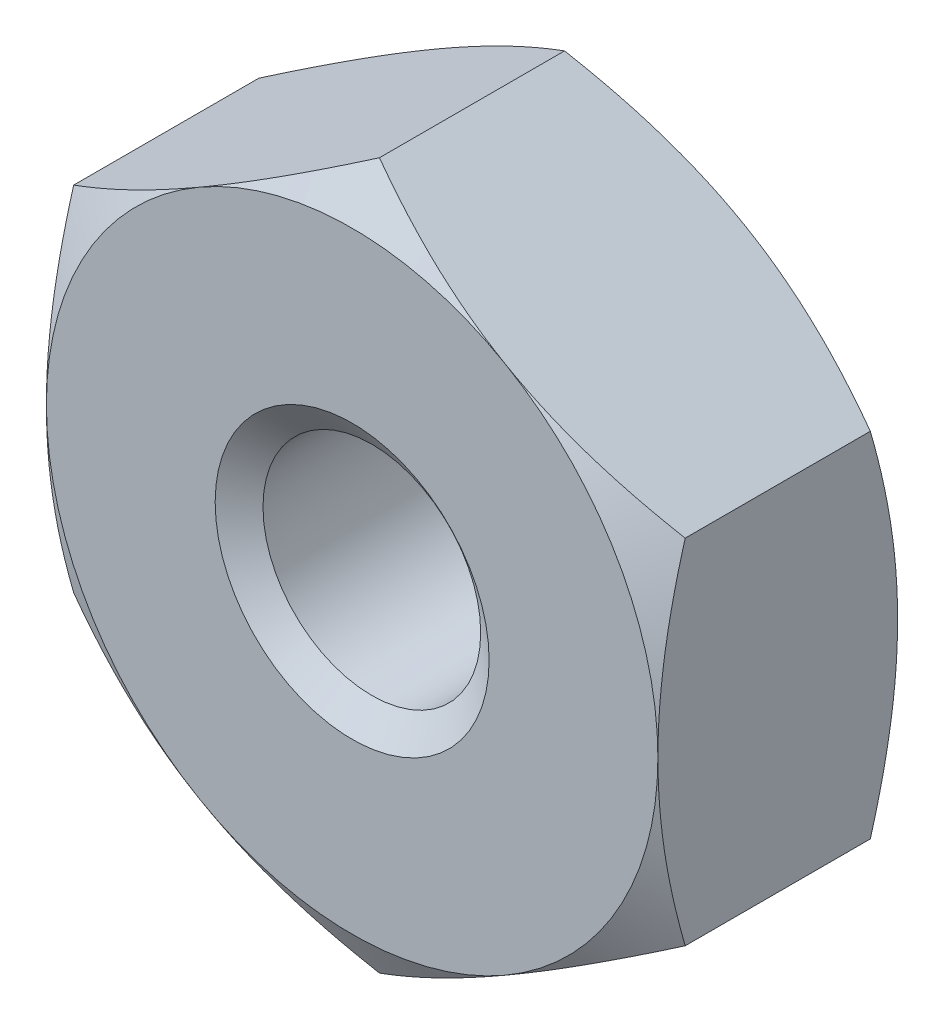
ISO-10303-21;
HEADER;
FILE_DESCRIPTION(('STEP AP214'),'2;1');
FILE_NAME('part.step','',(''),(''),'','','');
FILE_SCHEMA(('AUTOMOTIVE_DESIGN { 1 0 10303 214 1 1 1 1 }'));
ENDSEC;
DATA;
#1=APPLICATION_CONTEXT('core data for automotive mechanical design processes');
#2=APPLICATION_PROTOCOL_DEFINITION('international standard','automotive_design',2000,#1);
#3=PRODUCT_CONTEXT('',#1,'mechanical');
#4=PRODUCT('Part','Part','',(#3));
#5=PRODUCT_RELATED_PRODUCT_CATEGORY('part','',(#4));
#6=PRODUCT_DEFINITION_FORMATION('','',#4);
#7=PRODUCT_DEFINITION_CONTEXT('part definition',#1,'design');
#8=PRODUCT_DEFINITION('design','',#6,#7);
#9=PRODUCT_DEFINITION_SHAPE('','',#8);
#10=(LENGTH_UNIT() NAMED_UNIT(*) SI_UNIT(.MILLI.,.METRE.));
#11=(NAMED_UNIT(*) PLANE_ANGLE_UNIT() SI_UNIT($,.RADIAN.));
#12=(NAMED_UNIT(*) SI_UNIT($,.STERADIAN.) SOLID_ANGLE_UNIT());
#13=UNCERTAINTY_MEASURE_WITH_UNIT(LENGTH_MEASURE(1.E-05),#10,'distance_accuracy_value','');
#14=(GEOMETRIC_REPRESENTATION_CONTEXT(3) GLOBAL_UNCERTAINTY_ASSIGNED_CONTEXT((#13)) GLOBAL_UNIT_ASSIGNED_CONTEXT((#10,
#11,#12)) REPRESENTATION_CONTEXT('',''));
#15=CARTESIAN_POINT('',(0.,0.,0.));
#16=DIRECTION('',(0.,0.,1.));
#17=DIRECTION('',(1.,0.,0.));
#18=AXIS2_PLACEMENT_3D('',#15,#16,#17);
#19=CARTESIAN_POINT('',(0.,0.,-2.4892));
#20=DIRECTION('',(0.,0.,1.));
#21=DIRECTION('',(1.,0.,0.));
#22=AXIS2_PLACEMENT_3D('',#19,#20,#21);
#23=CYLINDRICAL_SURFACE('',#22,1.1303);
#24=CARTESIAN_POINT('',(0.,0.,-0.204530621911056));
#25=DIRECTION('',(0.,0.,1.));
#26=DIRECTION('',(1.,0.,0.));
#27=AXIS2_PLACEMENT_3D('',#24,#25,#26);
#28=CIRCLE('',#27,1.1303);
#29=CARTESIAN_POINT('',(1.1303,0.,-0.204530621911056));
#30=VERTEX_POINT('',#29);
#31=EDGE_CURVE('E170',#30,#30,#28,.F.);
#32=ORIENTED_EDGE('',*,*,#31,.F.);
#33=EDGE_LOOP('',(#32));
#34=FACE_BOUND('',#33,.T.);
#35=CARTESIAN_POINT('',(0.,0.,-2.25926937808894));
#36=DIRECTION('',(0.,0.,-1.));
#37=DIRECTION('',(-1.,0.,0.));
#38=AXIS2_PLACEMENT_3D('',#35,#36,#37);
#39=CIRCLE('',#38,1.1303);
#40=CARTESIAN_POINT('',(-1.1303,0.,-2.25926937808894));
#41=VERTEX_POINT('',#40);
#42=EDGE_CURVE('E35',#41,#41,#39,.F.);
#43=ORIENTED_EDGE('',*,*,#42,.F.);
#44=EDGE_LOOP('',(#43));
#45=FACE_BOUND('',#44,.T.);
#46=ADVANCED_FACE('F30',(#34,#45),#23,.F.);
#47=CARTESIAN_POINT('',(0.,3.66617420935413,-2.4892));
#48=DIRECTION('',(0.,0.,-1.));
#49=DIRECTION('',(-1.,0.,0.));
#50=AXIS2_PLACEMENT_3D('',#47,#48,#49);
#51=PLANE('',#50);
#52=CARTESIAN_POINT('',(0.,0.,-2.4892));
#53=DIRECTION('',(0.,0.,-1.));
#54=DIRECTION('',(-1.,0.,0.));
#55=AXIS2_PLACEMENT_3D('',#52,#53,#54);
#56=CIRCLE('',#55,3.175);
#57=CARTESIAN_POINT('',(-3.175,0.,-2.4892));
#58=VERTEX_POINT('',#57);
#59=CARTESIAN_POINT('',(-1.58750000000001,-2.74963065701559,-2.4892));
#60=VERTEX_POINT('',#59);
#61=EDGE_CURVE('E166',#58,#60,#56,.F.);
#62=ORIENTED_EDGE('',*,*,#61,.F.);
#63=CARTESIAN_POINT('',(-1.5875,2.74963065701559,-2.4892));
#64=VERTEX_POINT('',#63);
#65=EDGE_CURVE('E148',#64,#58,#56,.F.);
#66=ORIENTED_EDGE('',*,*,#65,.F.);
#67=CARTESIAN_POINT('',(1.58750000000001,2.74963065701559,-2.4892));
#68=VERTEX_POINT('',#67);
#69=EDGE_CURVE('E165',#68,#64,#56,.F.);
#70=ORIENTED_EDGE('',*,*,#69,.F.);
#71=CARTESIAN_POINT('',(0.,0.,-2.4892));
#72=DIRECTION('',(0.,0.,1.));
#73=DIRECTION('',(1.,0.,0.));
#74=AXIS2_PLACEMENT_3D('',#71,#72,#73);
#75=CIRCLE('',#74,3.175);
#76=CARTESIAN_POINT('',(3.175,0.,-2.4892));
#77=VERTEX_POINT('',#76);
#78=EDGE_CURVE('E240',#77,#68,#75,.T.);
#79=ORIENTED_EDGE('',*,*,#78,.F.);
#80=CARTESIAN_POINT('',(1.5875,-2.74963065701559,-2.4892));
#81=VERTEX_POINT('',#80);
#82=EDGE_CURVE('E372',#81,#77,#56,.F.);
#83=ORIENTED_EDGE('',*,*,#82,.F.);
#84=EDGE_CURVE('E393',#60,#81,#56,.F.);
#85=ORIENTED_EDGE('',*,*,#84,.F.);
#86=EDGE_LOOP('',(#62,#66,#70,#79,#83,#85));
#87=FACE_BOUND('',#86,.T.);
#88=CARTESIAN_POINT('',(0.,0.,-2.4892));
#89=DIRECTION('',(0.,0.,-1.));
#90=DIRECTION('',(-1.,0.,0.));
#91=AXIS2_PLACEMENT_3D('',#88,#89,#90);
#92=CIRCLE('',#91,1.4224);
#93=CARTESIAN_POINT('',(-1.4224,0.,-2.4892));
#94=VERTEX_POINT('',#93);
#95=EDGE_CURVE('E173',#94,#94,#92,.F.);
#96=ORIENTED_EDGE('',*,*,#95,.T.);
#97=EDGE_LOOP('',(#96));
#98=FACE_BOUND('',#97,.T.);
#99=ADVANCED_FACE('F245',(#87,#98),#51,.T.);
#100=CARTESIAN_POINT('',(0.,3.66617420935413,0.));
#101=DIRECTION('',(0.,0.,-1.));
#102=DIRECTION('',(-1.,0.,0.));
#103=AXIS2_PLACEMENT_3D('',#100,#101,#102);
#104=PLANE('',#103);
#105=CARTESIAN_POINT('',(0.,0.,0.));
#106=DIRECTION('',(0.,0.,-1.));
#107=DIRECTION('',(-1.,0.,0.));
#108=AXIS2_PLACEMENT_3D('',#105,#106,#107);
#109=CIRCLE('',#108,3.175);
#110=CARTESIAN_POINT('',(-3.175,0.,0.));
#111=VERTEX_POINT('',#110);
#112=CARTESIAN_POINT('',(-1.5875,2.74963065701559,0.));
#113=VERTEX_POINT('',#112);
#114=EDGE_CURVE('E11',#111,#113,#109,.T.);
#115=ORIENTED_EDGE('',*,*,#114,.F.);
#116=CARTESIAN_POINT('',(-1.58750000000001,-2.74963065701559,0.));
#117=VERTEX_POINT('',#116);
#118=EDGE_CURVE('E42',#117,#111,#109,.T.);
#119=ORIENTED_EDGE('',*,*,#118,.F.);
#120=CARTESIAN_POINT('',(1.5875,-2.74963065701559,0.));
#121=VERTEX_POINT('',#120);
#122=EDGE_CURVE('E169',#121,#117,#109,.T.);
#123=ORIENTED_EDGE('',*,*,#122,.F.);
#124=CARTESIAN_POINT('',(3.175,0.,0.));
#125=VERTEX_POINT('',#124);
#126=EDGE_CURVE('E338',#125,#121,#109,.T.);
#127=ORIENTED_EDGE('',*,*,#126,.F.);
#128=CARTESIAN_POINT('',(0.,0.,0.));
#129=DIRECTION('',(0.,0.,1.));
#130=DIRECTION('',(1.,0.,0.));
#131=AXIS2_PLACEMENT_3D('',#128,#129,#130);
#132=CIRCLE('',#131,3.175);
#133=CARTESIAN_POINT('',(1.58750000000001,2.74963065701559,0.));
#134=VERTEX_POINT('',#133);
#135=EDGE_CURVE('E124',#125,#134,#132,.T.);
#136=ORIENTED_EDGE('',*,*,#135,.T.);
#137=EDGE_CURVE('E40',#113,#134,#109,.T.);
#138=ORIENTED_EDGE('',*,*,#137,.F.);
#139=EDGE_LOOP('',(#115,#119,#123,#127,#136,#138));
#140=FACE_BOUND('',#139,.T.);
#141=CARTESIAN_POINT('',(0.,0.,0.));
#142=DIRECTION('',(0.,0.,1.));
#143=DIRECTION('',(1.,0.,0.));
#144=AXIS2_PLACEMENT_3D('',#141,#142,#143);
#145=CIRCLE('',#144,1.4224);
#146=CARTESIAN_POINT('',(1.4224,0.,0.));
#147=VERTEX_POINT('',#146);
#148=EDGE_CURVE('E172',#147,#147,#145,.T.);
#149=ORIENTED_EDGE('',*,*,#148,.F.);
#150=EDGE_LOOP('',(#149));
#151=FACE_BOUND('',#150,.T.);
#152=ADVANCED_FACE('F297',(#140,#151),#104,.F.);
#153=CARTESIAN_POINT('',(0.,3.66617420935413,-2.4892));
#154=DIRECTION('',(-0.500000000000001,0.866025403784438,0.));
#155=DIRECTION('',(-0.866025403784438,-0.500000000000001,0.));
#156=AXIS2_PLACEMENT_3D('',#153,#154,#155);
#157=PLANE('',#156);
#158=DIRECTION('',(0.,0.,1.));
#159=VECTOR('',#158,1.);
#160=CARTESIAN_POINT('',(-3.175,1.83308710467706,-2.4892));
#161=LINE('',#160,#159);
#162=CARTESIAN_POINT('',(-3.175,1.83308710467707,-2.20562043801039));
#163=VERTEX_POINT('',#162);
#164=CARTESIAN_POINT('',(-3.175,1.83308710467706,-0.283579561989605));
#165=VERTEX_POINT('',#164);
#166=EDGE_CURVE('E160',#163,#165,#161,.T.);
#167=ORIENTED_EDGE('',*,*,#166,.T.);
#168=CARTESIAN_POINT('',(-3.1752,1.83297163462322,-0.283646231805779));
#169=CARTESIAN_POINT('',(-3.03567460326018,1.91352665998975,-0.237119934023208));
#170=CARTESIAN_POINT('',(-2.89494483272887,1.99477703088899,-0.194805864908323));
#171=CARTESIAN_POINT('',(-2.61104837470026,2.15868472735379,-0.120946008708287));
#172=CARTESIAN_POINT('',(-2.46787664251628,2.24134496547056,-0.0894263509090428));
#173=CARTESIAN_POINT('',(-2.18330753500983,2.40564101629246,-0.0403611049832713));
#174=CARTESIAN_POINT('',(-2.0419539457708,2.48725154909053,-0.0224889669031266));
#175=CARTESIAN_POINT('',(-1.75858160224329,2.65085664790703,-0.00115281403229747));
#176=CARTESIAN_POINT('',(-1.61656387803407,2.73285061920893,0.00232886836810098));
#177=CARTESIAN_POINT('',(-1.35119263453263,2.88606277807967,-0.00491170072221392));
#178=CARTESIAN_POINT('',(-1.22779940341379,2.95730389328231,-0.0138561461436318));
#179=CARTESIAN_POINT('',(-0.981816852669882,3.09932198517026,-0.0422055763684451));
#180=CARTESIAN_POINT('',(-0.859228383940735,3.17009847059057,-0.0616202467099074));
#181=CARTESIAN_POINT('',(-0.612738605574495,3.31240941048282,-0.110155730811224));
#182=CARTESIAN_POINT('',(-0.48886849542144,3.38392585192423,-0.139482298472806));
#183=CARTESIAN_POINT('',(-0.242975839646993,3.52589204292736,-0.20604219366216));
#184=CARTESIAN_POINT('',(-0.120950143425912,3.59634361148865,-0.243259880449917));
#185=CARTESIAN_POINT('',(0.000200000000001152,3.66628967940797,-0.283646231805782));
#186=B_SPLINE_CURVE_WITH_KNOTS('',3,(#168,#169,#170,#171,#172,#173,#174,#175,#176,#177,#178,
#179,#180,#181,#182,#183,#184,#185),.UNSPECIFIED.,.F.,.F.,(4,2,2,2,2,2,2,2,4),(0.,
0.503278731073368,1.00776724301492,1.49976968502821,1.99116790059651,2.41904879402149,
2.84732618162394,3.28510386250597,3.72202181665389),.UNSPECIFIED.);
#187=EDGE_CURVE('E129',#165,#113,#186,.T.);
#188=ORIENTED_EDGE('',*,*,#187,.T.);
#189=CARTESIAN_POINT('',(0.,3.66617420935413,-0.283579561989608));
#190=VERTEX_POINT('',#189);
#191=EDGE_CURVE('E49',#113,#190,#186,.T.);
#192=ORIENTED_EDGE('',*,*,#191,.T.);
#193=DIRECTION('',(0.,0.,1.));
#194=VECTOR('',#193,1.);
#195=CARTESIAN_POINT('',(0.,3.66617420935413,-2.4892));
#196=LINE('',#195,#194);
#197=CARTESIAN_POINT('',(0.,3.66617420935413,-2.20562043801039));
#198=VERTEX_POINT('',#197);
#199=EDGE_CURVE('E145',#198,#190,#196,.T.);
#200=ORIENTED_EDGE('',*,*,#199,.F.);
#201=CARTESIAN_POINT('',(-3.1752,1.83297163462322,-2.20555376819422));
#202=CARTESIAN_POINT('',(-3.03567460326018,1.91352665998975,-2.25208006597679));
#203=CARTESIAN_POINT('',(-2.89494483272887,1.99477703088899,-2.29439413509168));
#204=CARTESIAN_POINT('',(-2.61104837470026,2.15868472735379,-2.36825399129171));
#205=CARTESIAN_POINT('',(-2.46787664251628,2.24134496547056,-2.39977364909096));
#206=CARTESIAN_POINT('',(-2.18330753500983,2.40564101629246,-2.44883889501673));
#207=CARTESIAN_POINT('',(-2.0419539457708,2.48725154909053,-2.46671103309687));
#208=CARTESIAN_POINT('',(-1.75858160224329,2.65085664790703,-2.4880471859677));
#209=CARTESIAN_POINT('',(-1.61656387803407,2.73285061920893,-2.4915288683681));
#210=CARTESIAN_POINT('',(-1.35119263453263,2.88606277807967,-2.48428829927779));
#211=CARTESIAN_POINT('',(-1.22779940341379,2.95730389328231,-2.47534385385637));
#212=CARTESIAN_POINT('',(-0.981816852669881,3.09932198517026,-2.44699442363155));
#213=CARTESIAN_POINT('',(-0.859228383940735,3.17009847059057,-2.42757975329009));
#214=CARTESIAN_POINT('',(-0.612738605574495,3.31240941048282,-2.37904426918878));
#215=CARTESIAN_POINT('',(-0.48886849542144,3.38392585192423,-2.34971770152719));
#216=CARTESIAN_POINT('',(-0.242975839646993,3.52589204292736,-2.28315780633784));
#217=CARTESIAN_POINT('',(-0.120950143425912,3.59634361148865,-2.24594011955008));
#218=CARTESIAN_POINT('',(0.000200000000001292,3.66628967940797,-2.20555376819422));
#219=B_SPLINE_CURVE_WITH_KNOTS('',3,(#201,#202,#203,#204,#205,#206,#207,#208,#209,#210,#211,
#212,#213,#214,#215,#216,#217,#218),.UNSPECIFIED.,.F.,.F.,(4,2,2,2,2,2,2,2,4),(0.,
0.503278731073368,1.00776724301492,1.49976968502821,1.99116790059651,2.41904879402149,
2.84732618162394,3.28510386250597,3.72202181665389),.UNSPECIFIED.);
#220=EDGE_CURVE('E163',#64,#198,#219,.T.);
#221=ORIENTED_EDGE('',*,*,#220,.F.);
#222=EDGE_CURVE('E255',#163,#64,#219,.T.);
#223=ORIENTED_EDGE('',*,*,#222,.F.);
#224=EDGE_LOOP('',(#167,#188,#192,#200,#221,#223));
#225=FACE_BOUND('',#224,.T.);
#226=ADVANCED_FACE('F32',(#225),#157,.T.);
#227=CARTESIAN_POINT('',(3.175,1.83308710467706,-2.4892));
#228=DIRECTION('',(0.500000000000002,0.866025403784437,0.));
#229=DIRECTION('',(-0.866025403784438,0.500000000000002,0.));
#230=AXIS2_PLACEMENT_3D('',#227,#228,#229);
#231=PLANE('',#230);
#232=ORIENTED_EDGE('',*,*,#199,.T.);
#233=CARTESIAN_POINT('',(-0.000199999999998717,3.66628967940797,-0.283646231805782));
#234=CARTESIAN_POINT('',(0.13932539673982,3.58573465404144,-0.237119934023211));
#235=CARTESIAN_POINT('',(0.28005516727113,3.5044842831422,-0.194805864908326));
#236=CARTESIAN_POINT('',(0.563951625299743,3.34057658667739,-0.120946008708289));
#237=CARTESIAN_POINT('',(0.707123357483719,3.25791634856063,-0.0894263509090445));
#238=CARTESIAN_POINT('',(0.991692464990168,3.09362029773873,-0.0403611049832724));
#239=CARTESIAN_POINT('',(1.1330460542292,3.01200976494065,-0.0224889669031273));
#240=CARTESIAN_POINT('',(1.41641839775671,2.84840466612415,-0.00115281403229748));
#241=CARTESIAN_POINT('',(1.55843612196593,2.76641069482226,0.00232886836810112));
#242=CARTESIAN_POINT('',(1.82380736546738,2.61319853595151,-0.00491170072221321));
#243=CARTESIAN_POINT('',(1.94720059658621,2.54195742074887,-0.0138561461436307));
#244=CARTESIAN_POINT('',(2.19318314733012,2.39993932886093,-0.0422055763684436));
#245=CARTESIAN_POINT('',(2.31577161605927,2.32916284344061,-0.0616202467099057));
#246=CARTESIAN_POINT('',(2.56226139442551,2.18685190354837,-0.110155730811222));
#247=CARTESIAN_POINT('',(2.68613150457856,2.11533546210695,-0.139482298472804));
#248=CARTESIAN_POINT('',(2.93202416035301,1.97336927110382,-0.206042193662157));
#249=CARTESIAN_POINT('',(3.05404985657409,1.90291770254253,-0.243259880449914));
#250=CARTESIAN_POINT('',(3.1752,1.83297163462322,-0.283646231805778));
#251=B_SPLINE_CURVE_WITH_KNOTS('',3,(#233,#234,#235,#236,#237,#238,#239,#240,#241,#242,#243,
#244,#245,#246,#247,#248,#249,#250),.UNSPECIFIED.,.F.,.F.,(4,2,2,2,2,2,2,2,4),(0.,
0.503278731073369,1.00776724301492,1.49976968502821,1.99116790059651,2.41904879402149,
2.84732618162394,3.28510386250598,3.72202181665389),.UNSPECIFIED.);
#252=EDGE_CURVE('E139',#190,#134,#251,.T.);
#253=ORIENTED_EDGE('',*,*,#252,.T.);
#254=CARTESIAN_POINT('',(3.175,1.83308710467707,-0.283579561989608));
#255=VERTEX_POINT('',#254);
#256=EDGE_CURVE('E56',#134,#255,#251,.T.);
#257=ORIENTED_EDGE('',*,*,#256,.T.);
#258=DIRECTION('',(0.,0.,1.));
#259=VECTOR('',#258,1.);
#260=CARTESIAN_POINT('',(3.175,1.83308710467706,-2.4892));
#261=LINE('',#260,#259);
#262=CARTESIAN_POINT('',(3.175,1.83308710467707,-2.20562043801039));
#263=VERTEX_POINT('',#262);
#264=EDGE_CURVE('E138',#263,#255,#261,.T.);
#265=ORIENTED_EDGE('',*,*,#264,.F.);
#266=CARTESIAN_POINT('',(-0.000199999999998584,3.66628967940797,-2.20555376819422));
#267=CARTESIAN_POINT('',(0.13932539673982,3.58573465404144,-2.25208006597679));
#268=CARTESIAN_POINT('',(0.28005516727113,3.5044842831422,-2.29439413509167));
#269=CARTESIAN_POINT('',(0.563951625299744,3.34057658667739,-2.36825399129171));
#270=CARTESIAN_POINT('',(0.70712335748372,3.25791634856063,-2.39977364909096));
#271=CARTESIAN_POINT('',(0.991692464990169,3.09362029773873,-2.44883889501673));
#272=CARTESIAN_POINT('',(1.1330460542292,3.01200976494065,-2.46671103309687));
#273=CARTESIAN_POINT('',(1.41641839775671,2.84840466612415,-2.4880471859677));
#274=CARTESIAN_POINT('',(1.55843612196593,2.76641069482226,-2.4915288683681));
#275=CARTESIAN_POINT('',(1.82380736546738,2.61319853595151,-2.48428829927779));
#276=CARTESIAN_POINT('',(1.94720059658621,2.54195742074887,-2.47534385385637));
#277=CARTESIAN_POINT('',(2.19318314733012,2.39993932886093,-2.44699442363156));
#278=CARTESIAN_POINT('',(2.31577161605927,2.32916284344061,-2.42757975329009));
#279=CARTESIAN_POINT('',(2.56226139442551,2.18685190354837,-2.37904426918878));
#280=CARTESIAN_POINT('',(2.68613150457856,2.11533546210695,-2.3497177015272));
#281=CARTESIAN_POINT('',(2.93202416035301,1.97336927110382,-2.28315780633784));
#282=CARTESIAN_POINT('',(3.05404985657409,1.90291770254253,-2.24594011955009));
#283=CARTESIAN_POINT('',(3.1752,1.83297163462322,-2.20555376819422));
#284=B_SPLINE_CURVE_WITH_KNOTS('',3,(#266,#267,#268,#269,#270,#271,#272,#273,#274,#275,#276,
#277,#278,#279,#280,#281,#282,#283),.UNSPECIFIED.,.F.,.F.,(4,2,2,2,2,2,2,2,4),(0.,
0.503278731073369,1.00776724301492,1.49976968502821,1.99116790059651,2.41904879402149,
2.84732618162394,3.28510386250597,3.72202181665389),.UNSPECIFIED.);
#285=EDGE_CURVE('E249',#68,#263,#284,.T.);
#286=ORIENTED_EDGE('',*,*,#285,.F.);
#287=EDGE_CURVE('E254',#198,#68,#284,.T.);
#288=ORIENTED_EDGE('',*,*,#287,.F.);
#289=EDGE_LOOP('',(#232,#253,#257,#265,#286,#288));
#290=FACE_BOUND('',#289,.T.);
#291=ADVANCED_FACE('F136',(#290),#231,.T.);
#292=CARTESIAN_POINT('',(3.175,1.83308710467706,-2.4892));
#293=DIRECTION('',(-1.,0.,0.));
#294=DIRECTION('',(0.,0.,1.));
#295=AXIS2_PLACEMENT_3D('',#292,#293,#294);
#296=PLANE('',#295);
#297=CARTESIAN_POINT('',(3.175,-4.8616171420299,-1.51932228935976));
#298=CARTESIAN_POINT('',(3.175,-4.7222166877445,-1.45195628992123));
#299=CARTESIAN_POINT('',(3.175,-4.58248664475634,-1.38525996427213));
#300=CARTESIAN_POINT('',(3.175,-4.30218917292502,-1.25358933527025));
#301=CARTESIAN_POINT('',(3.175,-4.16162160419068,-1.18861533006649));
#302=CARTESIAN_POINT('',(3.175,-3.87871153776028,-1.06042973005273));
#303=CARTESIAN_POINT('',(3.175,-3.73636348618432,-0.99723034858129));
#304=CARTESIAN_POINT('',(3.175,-3.45049740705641,-0.873546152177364));
#305=CARTESIAN_POINT('',(3.175,-3.30697944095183,-0.813061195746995));
#306=CARTESIAN_POINT('',(3.175,-3.01676360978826,-0.694809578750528));
#307=CARTESIAN_POINT('',(3.175,-2.87004833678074,-0.63708540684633));
#308=CARTESIAN_POINT('',(3.175,-2.57488727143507,-0.526158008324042));
#309=CARTESIAN_POINT('',(3.175,-2.42644128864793,-0.472955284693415));
#310=CARTESIAN_POINT('',(3.175,-2.12788752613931,-0.372500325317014));
#311=CARTESIAN_POINT('',(3.175,-1.97778404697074,-0.325235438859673));
#312=CARTESIAN_POINT('',(3.175,-1.67544317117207,-0.238191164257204));
#313=CARTESIAN_POINT('',(3.175,-1.52320646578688,-0.198409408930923));
#314=CARTESIAN_POINT('',(3.175,-1.21649515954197,-0.128262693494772));
#315=CARTESIAN_POINT('',(3.175,-1.06201997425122,-0.0979002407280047));
#316=CARTESIAN_POINT('',(3.175,-0.751207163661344,-0.0486364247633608));
#317=CARTESIAN_POINT('',(3.175,-0.5948695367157,-0.0297350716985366));
#318=CARTESIAN_POINT('',(3.175,-0.282140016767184,-0.00506556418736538));
#319=CARTESIAN_POINT('',(3.175,-0.125754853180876,0.000785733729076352));
#320=CARTESIAN_POINT('',(3.175,0.186905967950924,-0.000955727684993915));
#321=CARTESIAN_POINT('',(3.175,0.343181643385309,-0.00854499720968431));
#322=CARTESIAN_POINT('',(3.175,0.61004500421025,-0.0324474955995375));
#323=CARTESIAN_POINT('',(3.175,0.720927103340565,-0.0456480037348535));
#324=CARTESIAN_POINT('',(3.175,0.941834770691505,-0.0779568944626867));
#325=CARTESIAN_POINT('',(3.175,1.05186020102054,-0.0970662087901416));
#326=CARTESIAN_POINT('',(3.175,1.38056179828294,-0.162254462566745));
#327=CARTESIAN_POINT('',(3.175,1.59769723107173,-0.216176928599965));
#328=CARTESIAN_POINT('',(3.175,1.92260738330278,-0.30917861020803));
#329=CARTESIAN_POINT('',(3.175,2.03207569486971,-0.342672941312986));
#330=CARTESIAN_POINT('',(3.175,2.24986976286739,-0.412975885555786));
#331=CARTESIAN_POINT('',(3.175,2.35819625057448,-0.449782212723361));
#332=CARTESIAN_POINT('',(3.175,2.57325368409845,-0.525943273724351));
#333=CARTESIAN_POINT('',(3.175,2.67999017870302,-0.56528249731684));
#334=CARTESIAN_POINT('',(3.175,2.89263503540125,-0.646269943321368));
#335=CARTESIAN_POINT('',(3.175,2.99854304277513,-0.687919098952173));
#336=CARTESIAN_POINT('',(3.175,3.1040681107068,-0.730495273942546));
#337=B_SPLINE_CURVE_WITH_KNOTS('',3,(#297,#298,#299,#300,#301,#302,#303,#304,#305,#306,#307,
#308,#309,#310,#311,#312,#313,#314,#315,#316,#317,#318,#319,#320,#321,#322,#323,#324,#325,#326,
#327,#328,#329,#330,#331,#332,#333,#334,#335,#336),.UNSPECIFIED.,.F.,.F.,(4,2,2,2,2,2,2,2,2,2,2,
2,2,2,2,2,2,2,2,4),(0.,0.464480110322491,0.92904010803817,1.39625859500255,1.86345269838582,
2.33638249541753,2.80936483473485,3.28132173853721,3.7531290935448,4.22506193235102,
4.69699518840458,5.16591300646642,5.63470908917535,5.96954086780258,6.30442547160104,
6.97469308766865,7.31809942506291,7.66127053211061,8.00251004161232,8.34388843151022),.UNSPECIFIED.);
#338=CARTESIAN_POINT('',(3.175,-1.83308710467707,-0.283579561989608));
#339=VERTEX_POINT('',#338);
#340=EDGE_CURVE('E131',#339,#125,#337,.T.);
#341=ORIENTED_EDGE('',*,*,#340,.F.);
#342=DIRECTION('',(0.,0.,1.));
#343=VECTOR('',#342,1.);
#344=CARTESIAN_POINT('',(3.175,-1.83308710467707,-2.4892));
#345=LINE('',#344,#343);
#346=CARTESIAN_POINT('',(3.175,-1.83308710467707,-2.20562043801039));
#347=VERTEX_POINT('',#346);
#348=EDGE_CURVE('E146',#347,#339,#345,.T.);
#349=ORIENTED_EDGE('',*,*,#348,.F.);
#350=CARTESIAN_POINT('',(3.175,-4.8616171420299,-0.969877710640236));
#351=CARTESIAN_POINT('',(3.175,-4.7222166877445,-1.03724371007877));
#352=CARTESIAN_POINT('',(3.175,-4.58248664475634,-1.10394003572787));
#353=CARTESIAN_POINT('',(3.175,-4.30218917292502,-1.23561066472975));
#354=CARTESIAN_POINT('',(3.175,-4.16162160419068,-1.30058466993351));
#355=CARTESIAN_POINT('',(3.175,-3.87871153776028,-1.42877026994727));
#356=CARTESIAN_POINT('',(3.175,-3.73636348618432,-1.49196965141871));
#357=CARTESIAN_POINT('',(3.175,-3.45049740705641,-1.61565384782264));
#358=CARTESIAN_POINT('',(3.175,-3.30697944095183,-1.67613880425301));
#359=CARTESIAN_POINT('',(3.175,-3.01676360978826,-1.79439042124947));
#360=CARTESIAN_POINT('',(3.175,-2.87004833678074,-1.85211459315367));
#361=CARTESIAN_POINT('',(3.175,-2.57488727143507,-1.96304199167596));
#362=CARTESIAN_POINT('',(3.175,-2.42644128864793,-2.01624471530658));
#363=CARTESIAN_POINT('',(3.175,-2.12788752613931,-2.11669967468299));
#364=CARTESIAN_POINT('',(3.175,-1.97778404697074,-2.16396456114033));
#365=CARTESIAN_POINT('',(3.175,-1.67544317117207,-2.2510088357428));
#366=CARTESIAN_POINT('',(3.175,-1.52320646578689,-2.29079059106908));
#367=CARTESIAN_POINT('',(3.175,-1.21649515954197,-2.36093730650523));
#368=CARTESIAN_POINT('',(3.175,-1.06201997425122,-2.391299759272));
#369=CARTESIAN_POINT('',(3.175,-0.751207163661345,-2.44056357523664));
#370=CARTESIAN_POINT('',(3.175,-0.5948695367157,-2.45946492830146));
#371=CARTESIAN_POINT('',(3.175,-0.282140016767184,-2.48413443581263));
#372=CARTESIAN_POINT('',(3.175,-0.125754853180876,-2.48998573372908));
#373=CARTESIAN_POINT('',(3.175,0.186905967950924,-2.48824427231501));
#374=CARTESIAN_POINT('',(3.175,0.343181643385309,-2.48065500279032));
#375=CARTESIAN_POINT('',(3.175,0.61004500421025,-2.45675250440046));
#376=CARTESIAN_POINT('',(3.175,0.720927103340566,-2.44355199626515));
#377=CARTESIAN_POINT('',(3.175,0.941834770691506,-2.41124310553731));
#378=CARTESIAN_POINT('',(3.175,1.05186020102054,-2.39213379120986));
#379=CARTESIAN_POINT('',(3.175,1.38056179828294,-2.32694553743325));
#380=CARTESIAN_POINT('',(3.175,1.59769723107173,-2.27302307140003));
#381=CARTESIAN_POINT('',(3.175,1.92260738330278,-2.18002138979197));
#382=CARTESIAN_POINT('',(3.175,2.03207569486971,-2.14652705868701));
#383=CARTESIAN_POINT('',(3.175,2.24986976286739,-2.07622411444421));
#384=CARTESIAN_POINT('',(3.175,2.35819625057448,-2.03941778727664));
#385=CARTESIAN_POINT('',(3.175,2.57325368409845,-1.96325672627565));
#386=CARTESIAN_POINT('',(3.175,2.67999017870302,-1.92391750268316));
#387=CARTESIAN_POINT('',(3.175,2.89263503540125,-1.84293005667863));
#388=CARTESIAN_POINT('',(3.175,2.99854304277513,-1.80128090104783));
#389=CARTESIAN_POINT('',(3.175,3.1040681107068,-1.75870472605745));
#390=B_SPLINE_CURVE_WITH_KNOTS('',3,(#350,#351,#352,#353,#354,#355,#356,#357,#358,#359,#360,
#361,#362,#363,#364,#365,#366,#367,#368,#369,#370,#371,#372,#373,#374,#375,#376,#377,#378,#379,
#380,#381,#382,#383,#384,#385,#386,#387,#388,#389),.UNSPECIFIED.,.F.,.F.,(4,2,2,2,2,2,2,2,2,2,2,
2,2,2,2,2,2,2,2,4),(0.,0.464480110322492,0.929040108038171,1.39625859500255,1.86345269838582,
2.33638249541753,2.80936483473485,3.28132173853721,3.7531290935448,4.22506193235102,
4.69699518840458,5.16591300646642,5.63470908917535,5.96954086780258,6.30442547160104,
6.97469308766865,7.31809942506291,7.66127053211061,8.00251004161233,8.34388843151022),.UNSPECIFIED.);
#391=EDGE_CURVE('E261',#347,#77,#390,.T.);
#392=ORIENTED_EDGE('',*,*,#391,.T.);
#393=EDGE_CURVE('E144',#77,#263,#390,.T.);
#394=ORIENTED_EDGE('',*,*,#393,.T.);
#395=ORIENTED_EDGE('',*,*,#264,.T.);
#396=EDGE_CURVE('E121',#125,#255,#337,.T.);
#397=ORIENTED_EDGE('',*,*,#396,.F.);
#398=EDGE_LOOP('',(#341,#349,#392,#394,#395,#397));
#399=FACE_BOUND('',#398,.T.);
#400=ADVANCED_FACE('F142',(#399),#296,.F.);
#401=CARTESIAN_POINT('',(0.,-3.66617420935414,-2.4892));
#402=DIRECTION('',(0.500000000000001,-0.866025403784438,0.));
#403=DIRECTION('',(0.866025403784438,0.500000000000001,0.));
#404=AXIS2_PLACEMENT_3D('',#401,#402,#403);
#405=PLANE('',#404);
#406=ORIENTED_EDGE('',*,*,#348,.T.);
#407=CARTESIAN_POINT('',(3.1752,-1.83297163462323,-0.283646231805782));
#408=CARTESIAN_POINT('',(3.03567460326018,-1.91352665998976,-0.237119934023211));
#409=CARTESIAN_POINT('',(2.89494483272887,-1.994777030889,-0.194805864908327));
#410=CARTESIAN_POINT('',(2.61104837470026,-2.1586847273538,-0.120946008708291));
#411=CARTESIAN_POINT('',(2.46787664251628,-2.24134496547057,-0.0894263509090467));
#412=CARTESIAN_POINT('',(2.18330753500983,-2.40564101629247,-0.0403611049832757));
#413=CARTESIAN_POINT('',(2.0419539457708,-2.48725154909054,-0.0224889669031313));
#414=CARTESIAN_POINT('',(1.75858160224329,-2.65085664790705,-0.00115281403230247));
#415=CARTESIAN_POINT('',(1.61656387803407,-2.73285061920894,0.00232886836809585));
#416=CARTESIAN_POINT('',(1.35119263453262,-2.88606277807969,-0.00491170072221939));
#417=CARTESIAN_POINT('',(1.22779940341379,-2.95730389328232,-0.0138561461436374));
#418=CARTESIAN_POINT('',(0.981816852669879,-3.09932198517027,-0.042205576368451));
#419=CARTESIAN_POINT('',(0.859228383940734,-3.17009847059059,-0.0616202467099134));
#420=CARTESIAN_POINT('',(0.612738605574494,-3.31240941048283,-0.11015573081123));
#421=CARTESIAN_POINT('',(0.488868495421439,-3.38392585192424,-0.139482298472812));
#422=CARTESIAN_POINT('',(0.242975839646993,-3.52589204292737,-0.206042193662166));
#423=CARTESIAN_POINT('',(0.120950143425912,-3.59634361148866,-0.243259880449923));
#424=CARTESIAN_POINT('',(-0.000200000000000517,-3.66628967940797,-0.283646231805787));
#425=B_SPLINE_CURVE_WITH_KNOTS('',3,(#407,#408,#409,#410,#411,#412,#413,#414,#415,#416,#417,
#418,#419,#420,#421,#422,#423,#424),.UNSPECIFIED.,.F.,.F.,(4,2,2,2,2,2,2,2,4),(0.,
0.503278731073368,1.00776724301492,1.49976968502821,1.99116790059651,2.41904879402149,
2.84732618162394,3.28510386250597,3.72202181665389),.UNSPECIFIED.);
#426=EDGE_CURVE('E341',#339,#121,#425,.T.);
#427=ORIENTED_EDGE('',*,*,#426,.T.);
#428=CARTESIAN_POINT('',(0.,-3.66617420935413,-0.283579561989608));
#429=VERTEX_POINT('',#428);
#430=EDGE_CURVE('E221',#121,#429,#425,.T.);
#431=ORIENTED_EDGE('',*,*,#430,.T.);
#432=DIRECTION('',(0.,0.,1.));
#433=VECTOR('',#432,1.);
#434=CARTESIAN_POINT('',(0.,-3.66617420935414,-2.4892));
#435=LINE('',#434,#433);
#436=CARTESIAN_POINT('',(0.,-3.66617420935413,-2.20562043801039));
#437=VERTEX_POINT('',#436);
#438=EDGE_CURVE('E151',#437,#429,#435,.T.);
#439=ORIENTED_EDGE('',*,*,#438,.F.);
#440=CARTESIAN_POINT('',(3.1752,-1.83297163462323,-2.20555376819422));
#441=CARTESIAN_POINT('',(3.03567460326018,-1.91352665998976,-2.25208006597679));
#442=CARTESIAN_POINT('',(2.89494483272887,-1.994777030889,-2.29439413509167));
#443=CARTESIAN_POINT('',(2.61104837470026,-2.1586847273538,-2.36825399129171));
#444=CARTESIAN_POINT('',(2.46787664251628,-2.24134496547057,-2.39977364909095));
#445=CARTESIAN_POINT('',(2.18330753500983,-2.40564101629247,-2.44883889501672));
#446=CARTESIAN_POINT('',(2.0419539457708,-2.48725154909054,-2.46671103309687));
#447=CARTESIAN_POINT('',(1.75858160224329,-2.65085664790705,-2.4880471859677));
#448=CARTESIAN_POINT('',(1.61656387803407,-2.73285061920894,-2.4915288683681));
#449=CARTESIAN_POINT('',(1.35119263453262,-2.88606277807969,-2.48428829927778));
#450=CARTESIAN_POINT('',(1.22779940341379,-2.95730389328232,-2.47534385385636));
#451=CARTESIAN_POINT('',(0.981816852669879,-3.09932198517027,-2.44699442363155));
#452=CARTESIAN_POINT('',(0.859228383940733,-3.17009847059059,-2.42757975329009));
#453=CARTESIAN_POINT('',(0.612738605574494,-3.31240941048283,-2.37904426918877));
#454=CARTESIAN_POINT('',(0.488868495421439,-3.38392585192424,-2.34971770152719));
#455=CARTESIAN_POINT('',(0.242975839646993,-3.52589204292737,-2.28315780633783));
#456=CARTESIAN_POINT('',(0.120950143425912,-3.59634361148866,-2.24594011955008));
#457=CARTESIAN_POINT('',(-0.00020000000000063,-3.66628967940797,-2.20555376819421));
#458=B_SPLINE_CURVE_WITH_KNOTS('',3,(#440,#441,#442,#443,#444,#445,#446,#447,#448,#449,#450,
#451,#452,#453,#454,#455,#456,#457),.UNSPECIFIED.,.F.,.F.,(4,2,2,2,2,2,2,2,4),(0.,
0.503278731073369,1.00776724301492,1.49976968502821,1.99116790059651,2.41904879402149,
2.84732618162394,3.28510386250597,3.72202181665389),.UNSPECIFIED.);
#459=EDGE_CURVE('E267',#81,#437,#458,.T.);
#460=ORIENTED_EDGE('',*,*,#459,.F.);
#461=EDGE_CURVE('E266',#347,#81,#458,.T.);
#462=ORIENTED_EDGE('',*,*,#461,.F.);
#463=EDGE_LOOP('',(#406,#427,#431,#439,#460,#462));
#464=FACE_BOUND('',#463,.T.);
#465=ADVANCED_FACE('F277',(#464),#405,.T.);
#466=CARTESIAN_POINT('',(-3.175,-1.83308710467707,-2.4892));
#467=DIRECTION('',(-0.500000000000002,-0.866025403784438,0.));
#468=DIRECTION('',(0.866025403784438,-0.500000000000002,0.));
#469=AXIS2_PLACEMENT_3D('',#466,#467,#468);
#470=PLANE('',#469);
#471=ORIENTED_EDGE('',*,*,#438,.T.);
#472=CARTESIAN_POINT('',(0.000199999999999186,-3.66628967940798,-0.283646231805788));
#473=CARTESIAN_POINT('',(-0.13932539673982,-3.58573465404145,-0.237119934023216));
#474=CARTESIAN_POINT('',(-0.28005516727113,-3.5044842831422,-0.194805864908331));
#475=CARTESIAN_POINT('',(-0.563951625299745,-3.3405765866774,-0.120946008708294));
#476=CARTESIAN_POINT('',(-0.707123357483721,-3.25791634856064,-0.0894263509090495));
#477=CARTESIAN_POINT('',(-0.991692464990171,-3.09362029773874,-0.0403611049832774));
#478=CARTESIAN_POINT('',(-1.1330460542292,-3.01200976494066,-0.0224889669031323));
#479=CARTESIAN_POINT('',(-1.41641839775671,-2.84840466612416,-0.00115281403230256));
#480=CARTESIAN_POINT('',(-1.55843612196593,-2.76641069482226,0.00232886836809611));
#481=CARTESIAN_POINT('',(-1.82380736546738,-2.61319853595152,-0.0049117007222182));
#482=CARTESIAN_POINT('',(-1.94720059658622,-2.54195742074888,-0.0138561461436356));
#483=CARTESIAN_POINT('',(-2.19318314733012,-2.39993932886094,-0.0422055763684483));
#484=CARTESIAN_POINT('',(-2.31577161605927,-2.32916284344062,-0.0616202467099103));
#485=CARTESIAN_POINT('',(-2.56226139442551,-2.18685190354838,-0.110155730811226));
#486=CARTESIAN_POINT('',(-2.68613150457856,-2.11533546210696,-0.139482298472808));
#487=CARTESIAN_POINT('',(-2.93202416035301,-1.97336927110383,-0.206042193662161));
#488=CARTESIAN_POINT('',(-3.05404985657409,-1.90291770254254,-0.243259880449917));
#489=CARTESIAN_POINT('',(-3.1752,-1.83297163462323,-0.283646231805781));
#490=B_SPLINE_CURVE_WITH_KNOTS('',3,(#472,#473,#474,#475,#476,#477,#478,#479,#480,#481,#482,
#483,#484,#485,#486,#487,#488,#489),.UNSPECIFIED.,.F.,.F.,(4,2,2,2,2,2,2,2,4),(0.,
0.50327873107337,1.00776724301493,1.49976968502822,1.99116790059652,2.41904879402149,
2.84732618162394,3.28510386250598,3.72202181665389),.UNSPECIFIED.);
#491=EDGE_CURVE('E344',#429,#117,#490,.T.);
#492=ORIENTED_EDGE('',*,*,#491,.T.);
#493=CARTESIAN_POINT('',(-3.175,-1.83308710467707,-0.283579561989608));
#494=VERTEX_POINT('',#493);
#495=EDGE_CURVE('E195',#117,#494,#490,.T.);
#496=ORIENTED_EDGE('',*,*,#495,.T.);
#497=DIRECTION('',(0.,0.,1.));
#498=VECTOR('',#497,1.);
#499=CARTESIAN_POINT('',(-3.175,-1.83308710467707,-2.4892));
#500=LINE('',#499,#498);
#501=CARTESIAN_POINT('',(-3.175,-1.83308710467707,-2.20562043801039));
#502=VERTEX_POINT('',#501);
#503=EDGE_CURVE('E157',#502,#494,#500,.T.);
#504=ORIENTED_EDGE('',*,*,#503,.F.);
#505=CARTESIAN_POINT('',(0.000199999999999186,-3.66628967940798,-2.20555376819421));
#506=CARTESIAN_POINT('',(-0.13932539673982,-3.58573465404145,-2.25208006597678));
#507=CARTESIAN_POINT('',(-0.28005516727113,-3.5044842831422,-2.29439413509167));
#508=CARTESIAN_POINT('',(-0.563951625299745,-3.3405765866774,-2.36825399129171));
#509=CARTESIAN_POINT('',(-0.707123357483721,-3.25791634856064,-2.39977364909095));
#510=CARTESIAN_POINT('',(-0.991692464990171,-3.09362029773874,-2.44883889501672));
#511=CARTESIAN_POINT('',(-1.1330460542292,-3.01200976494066,-2.46671103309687));
#512=CARTESIAN_POINT('',(-1.41641839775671,-2.84840466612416,-2.4880471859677));
#513=CARTESIAN_POINT('',(-1.55843612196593,-2.76641069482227,-2.4915288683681));
#514=CARTESIAN_POINT('',(-1.82380736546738,-2.61319853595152,-2.48428829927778));
#515=CARTESIAN_POINT('',(-1.94720059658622,-2.54195742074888,-2.47534385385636));
#516=CARTESIAN_POINT('',(-2.19318314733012,-2.39993932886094,-2.44699442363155));
#517=CARTESIAN_POINT('',(-2.31577161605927,-2.32916284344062,-2.42757975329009));
#518=CARTESIAN_POINT('',(-2.56226139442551,-2.18685190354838,-2.37904426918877));
#519=CARTESIAN_POINT('',(-2.68613150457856,-2.11533546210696,-2.34971770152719));
#520=CARTESIAN_POINT('',(-2.93202416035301,-1.97336927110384,-2.28315780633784));
#521=CARTESIAN_POINT('',(-3.05404985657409,-1.90291770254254,-2.24594011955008));
#522=CARTESIAN_POINT('',(-3.1752,-1.83297163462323,-2.20555376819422));
#523=B_SPLINE_CURVE_WITH_KNOTS('',3,(#505,#506,#507,#508,#509,#510,#511,#512,#513,#514,#515,
#516,#517,#518,#519,#520,#521,#522),.UNSPECIFIED.,.F.,.F.,(4,2,2,2,2,2,2,2,4),(0.,
0.50327873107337,1.00776724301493,1.49976968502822,1.99116790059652,2.41904879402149,
2.84732618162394,3.28510386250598,3.72202181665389),.UNSPECIFIED.);
#524=EDGE_CURVE('E273',#60,#502,#523,.T.);
#525=ORIENTED_EDGE('',*,*,#524,.F.);
#526=EDGE_CURVE('E272',#437,#60,#523,.T.);
#527=ORIENTED_EDGE('',*,*,#526,.F.);
#528=EDGE_LOOP('',(#471,#492,#496,#504,#525,#527));
#529=FACE_BOUND('',#528,.T.);
#530=ADVANCED_FACE('F280',(#529),#470,.T.);
#531=CARTESIAN_POINT('',(-3.175,1.83308710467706,-2.4892));
#532=DIRECTION('',(-1.,0.,0.));
#533=DIRECTION('',(0.,0.,1.));
#534=AXIS2_PLACEMENT_3D('',#531,#532,#533);
#535=PLANE('',#534);
#536=ORIENTED_EDGE('',*,*,#503,.T.);
#537=CARTESIAN_POINT('',(-3.175,-4.8616171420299,-1.51932228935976));
#538=CARTESIAN_POINT('',(-3.175,-4.72221668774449,-1.45195628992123));
#539=CARTESIAN_POINT('',(-3.175,-4.58248664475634,-1.38525996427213));
#540=CARTESIAN_POINT('',(-3.175,-4.30218917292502,-1.25358933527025));
#541=CARTESIAN_POINT('',(-3.175,-4.16162160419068,-1.18861533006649));
#542=CARTESIAN_POINT('',(-3.175,-3.87871153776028,-1.06042973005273));
#543=CARTESIAN_POINT('',(-3.175,-3.73636348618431,-0.997230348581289));
#544=CARTESIAN_POINT('',(-3.175,-3.4504974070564,-0.873546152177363));
#545=CARTESIAN_POINT('',(-3.175,-3.30697944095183,-0.813061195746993));
#546=CARTESIAN_POINT('',(-3.175,-3.01676360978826,-0.694809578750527));
#547=CARTESIAN_POINT('',(-3.175,-2.87004833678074,-0.637085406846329));
#548=CARTESIAN_POINT('',(-3.175,-2.57488727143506,-0.526158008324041));
#549=CARTESIAN_POINT('',(-3.175,-2.42644128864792,-0.472955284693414));
#550=CARTESIAN_POINT('',(-3.175,-2.1278875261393,-0.372500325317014));
#551=CARTESIAN_POINT('',(-3.175,-1.97778404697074,-0.325235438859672));
#552=CARTESIAN_POINT('',(-3.175,-1.67544317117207,-0.238191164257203));
#553=CARTESIAN_POINT('',(-3.175,-1.52320646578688,-0.198409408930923));
#554=CARTESIAN_POINT('',(-3.175,-1.21649515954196,-0.128262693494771));
#555=CARTESIAN_POINT('',(-3.175,-1.06201997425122,-0.0979002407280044));
#556=CARTESIAN_POINT('',(-3.175,-0.751207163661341,-0.0486364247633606));
#557=CARTESIAN_POINT('',(-3.175,-0.594869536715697,-0.0297350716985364));
#558=CARTESIAN_POINT('',(-3.175,-0.282140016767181,-0.00506556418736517));
#559=CARTESIAN_POINT('',(-3.175,-0.125754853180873,0.000785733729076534));
#560=CARTESIAN_POINT('',(-3.175,0.186905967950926,-0.000955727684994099));
#561=CARTESIAN_POINT('',(-3.175,0.343181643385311,-0.00854499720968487));
#562=CARTESIAN_POINT('',(-3.175,0.610045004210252,-0.032447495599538));
#563=CARTESIAN_POINT('',(-3.175,0.720927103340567,-0.0456480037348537));
#564=CARTESIAN_POINT('',(-3.175,0.941834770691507,-0.0779568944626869));
#565=CARTESIAN_POINT('',(-3.175,1.05186020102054,-0.0970662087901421));
#566=CARTESIAN_POINT('',(-3.175,1.38056179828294,-0.162254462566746));
#567=CARTESIAN_POINT('',(-3.175,1.59769723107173,-0.216176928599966));
#568=CARTESIAN_POINT('',(-3.175,1.92260738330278,-0.309178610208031));
#569=CARTESIAN_POINT('',(-3.175,2.03207569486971,-0.342672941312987));
#570=CARTESIAN_POINT('',(-3.175,2.24986976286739,-0.412975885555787));
#571=CARTESIAN_POINT('',(-3.175,2.35819625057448,-0.449782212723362));
#572=CARTESIAN_POINT('',(-3.175,2.57325368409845,-0.525943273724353));
#573=CARTESIAN_POINT('',(-3.175,2.67999017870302,-0.565282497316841));
#574=CARTESIAN_POINT('',(-3.175,2.89263503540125,-0.646269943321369));
#575=CARTESIAN_POINT('',(-3.175,2.99854304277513,-0.687919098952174));
#576=CARTESIAN_POINT('',(-3.175,3.1040681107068,-0.730495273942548));
#577=B_SPLINE_CURVE_WITH_KNOTS('',3,(#537,#538,#539,#540,#541,#542,#543,#544,#545,#546,#547,
#548,#549,#550,#551,#552,#553,#554,#555,#556,#557,#558,#559,#560,#561,#562,#563,#564,#565,#566,
#567,#568,#569,#570,#571,#572,#573,#574,#575,#576),.UNSPECIFIED.,.F.,.F.,(4,2,2,2,2,2,2,2,2,2,2,
2,2,2,2,2,2,2,2,4),(0.,0.464480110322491,0.92904010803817,1.39625859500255,1.86345269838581,
2.33638249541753,2.80936483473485,3.28132173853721,3.7531290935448,4.22506193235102,
4.69699518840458,5.16591300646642,5.63470908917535,5.96954086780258,6.30442547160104,
6.97469308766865,7.31809942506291,7.66127053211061,8.00251004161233,8.34388843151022),.UNSPECIFIED.);
#578=EDGE_CURVE('E194',#494,#111,#577,.T.);
#579=ORIENTED_EDGE('',*,*,#578,.T.);
#580=EDGE_CURVE('E187',#111,#165,#577,.T.);
#581=ORIENTED_EDGE('',*,*,#580,.T.);
#582=ORIENTED_EDGE('',*,*,#166,.F.);
#583=CARTESIAN_POINT('',(-3.175,-4.8616171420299,-0.969877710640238));
#584=CARTESIAN_POINT('',(-3.175,-4.72221668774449,-1.03724371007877));
#585=CARTESIAN_POINT('',(-3.175,-4.58248664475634,-1.10394003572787));
#586=CARTESIAN_POINT('',(-3.175,-4.30218917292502,-1.23561066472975));
#587=CARTESIAN_POINT('',(-3.175,-4.16162160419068,-1.30058466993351));
#588=CARTESIAN_POINT('',(-3.175,-3.87871153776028,-1.42877026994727));
#589=CARTESIAN_POINT('',(-3.175,-3.73636348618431,-1.49196965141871));
#590=CARTESIAN_POINT('',(-3.175,-3.4504974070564,-1.61565384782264));
#591=CARTESIAN_POINT('',(-3.175,-3.30697944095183,-1.67613880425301));
#592=CARTESIAN_POINT('',(-3.175,-3.01676360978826,-1.79439042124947));
#593=CARTESIAN_POINT('',(-3.175,-2.87004833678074,-1.85211459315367));
#594=CARTESIAN_POINT('',(-3.175,-2.57488727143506,-1.96304199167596));
#595=CARTESIAN_POINT('',(-3.175,-2.42644128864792,-2.01624471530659));
#596=CARTESIAN_POINT('',(-3.175,-2.12788752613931,-2.11669967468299));
#597=CARTESIAN_POINT('',(-3.175,-1.97778404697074,-2.16396456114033));
#598=CARTESIAN_POINT('',(-3.175,-1.67544317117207,-2.2510088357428));
#599=CARTESIAN_POINT('',(-3.175,-1.52320646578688,-2.29079059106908));
#600=CARTESIAN_POINT('',(-3.175,-1.21649515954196,-2.36093730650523));
#601=CARTESIAN_POINT('',(-3.175,-1.06201997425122,-2.391299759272));
#602=CARTESIAN_POINT('',(-3.175,-0.751207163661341,-2.44056357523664));
#603=CARTESIAN_POINT('',(-3.175,-0.594869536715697,-2.45946492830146));
#604=CARTESIAN_POINT('',(-3.175,-0.28214001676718,-2.48413443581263));
#605=CARTESIAN_POINT('',(-3.175,-0.125754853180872,-2.48998573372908));
#606=CARTESIAN_POINT('',(-3.175,0.186905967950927,-2.48824427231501));
#607=CARTESIAN_POINT('',(-3.175,0.343181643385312,-2.48065500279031));
#608=CARTESIAN_POINT('',(-3.175,0.610045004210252,-2.45675250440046));
#609=CARTESIAN_POINT('',(-3.175,0.720927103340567,-2.44355199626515));
#610=CARTESIAN_POINT('',(-3.175,0.941834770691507,-2.41124310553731));
#611=CARTESIAN_POINT('',(-3.175,1.05186020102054,-2.39213379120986));
#612=CARTESIAN_POINT('',(-3.175,1.38056179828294,-2.32694553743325));
#613=CARTESIAN_POINT('',(-3.175,1.59769723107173,-2.27302307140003));
#614=CARTESIAN_POINT('',(-3.175,1.92260738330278,-2.18002138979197));
#615=CARTESIAN_POINT('',(-3.175,2.03207569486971,-2.14652705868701));
#616=CARTESIAN_POINT('',(-3.175,2.24986976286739,-2.07622411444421));
#617=CARTESIAN_POINT('',(-3.175,2.35819625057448,-2.03941778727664));
#618=CARTESIAN_POINT('',(-3.175,2.57325368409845,-1.96325672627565));
#619=CARTESIAN_POINT('',(-3.175,2.67999017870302,-1.92391750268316));
#620=CARTESIAN_POINT('',(-3.175,2.89263503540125,-1.84293005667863));
#621=CARTESIAN_POINT('',(-3.175,2.99854304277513,-1.80128090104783));
#622=CARTESIAN_POINT('',(-3.175,3.1040681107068,-1.75870472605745));
#623=B_SPLINE_CURVE_WITH_KNOTS('',3,(#583,#584,#585,#586,#587,#588,#589,#590,#591,#592,#593,
#594,#595,#596,#597,#598,#599,#600,#601,#602,#603,#604,#605,#606,#607,#608,#609,#610,#611,#612,
#613,#614,#615,#616,#617,#618,#619,#620,#621,#622),.UNSPECIFIED.,.F.,.F.,(4,2,2,2,2,2,2,2,2,2,2,
2,2,2,2,2,2,2,2,4),(0.,0.46448011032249,0.92904010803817,1.39625859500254,1.86345269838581,
2.33638249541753,2.80936483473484,3.2813217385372,3.7531290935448,4.22506193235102,
4.69699518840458,5.16591300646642,5.63470908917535,5.96954086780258,6.30442547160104,
6.97469308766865,7.31809942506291,7.66127053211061,8.00251004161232,8.34388843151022),.UNSPECIFIED.);
#624=EDGE_CURVE('E356',#58,#163,#623,.T.);
#625=ORIENTED_EDGE('',*,*,#624,.F.);
#626=EDGE_CURVE('E358',#502,#58,#623,.T.);
#627=ORIENTED_EDGE('',*,*,#626,.F.);
#628=EDGE_LOOP('',(#536,#579,#581,#582,#625,#627));
#629=FACE_BOUND('',#628,.T.);
#630=ADVANCED_FACE('F201',(#629),#535,.T.);
#631=CARTESIAN_POINT('',(0.,0.,-2.4892));
#632=DIRECTION('',(0.,0.,1.));
#633=DIRECTION('',(1.,0.,0.));
#634=AXIS2_PLACEMENT_3D('',#631,#632,#633);
#635=CONICAL_SURFACE('',#634,3.175,1.0471975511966);
#636=ORIENTED_EDGE('',*,*,#222,.T.);
#637=ORIENTED_EDGE('',*,*,#65,.T.);
#638=ORIENTED_EDGE('',*,*,#624,.T.);
#639=EDGE_LOOP('',(#636,#637,#638));
#640=FACE_BOUND('',#639,.T.);
#641=ADVANCED_FACE('F290',(#640),#635,.T.);
#642=ORIENTED_EDGE('',*,*,#220,.T.);
#643=ORIENTED_EDGE('',*,*,#287,.T.);
#644=ORIENTED_EDGE('',*,*,#69,.T.);
#645=EDGE_LOOP('',(#642,#643,#644));
#646=FACE_BOUND('',#645,.T.);
#647=ADVANCED_FACE('F374',(#646),#635,.T.);
#648=ORIENTED_EDGE('',*,*,#285,.T.);
#649=ORIENTED_EDGE('',*,*,#393,.F.);
#650=ORIENTED_EDGE('',*,*,#78,.T.);
#651=EDGE_LOOP('',(#648,#649,#650));
#652=FACE_BOUND('',#651,.T.);
#653=ADVANCED_FACE('F367',(#652),#635,.T.);
#654=ORIENTED_EDGE('',*,*,#461,.T.);
#655=ORIENTED_EDGE('',*,*,#82,.T.);
#656=ORIENTED_EDGE('',*,*,#391,.F.);
#657=EDGE_LOOP('',(#654,#655,#656));
#658=FACE_BOUND('',#657,.T.);
#659=ADVANCED_FACE('F380',(#658),#635,.T.);
#660=ORIENTED_EDGE('',*,*,#459,.T.);
#661=ORIENTED_EDGE('',*,*,#526,.T.);
#662=ORIENTED_EDGE('',*,*,#84,.T.);
#663=EDGE_LOOP('',(#660,#661,#662));
#664=FACE_BOUND('',#663,.T.);
#665=ADVANCED_FACE('F381',(#664),#635,.T.);
#666=ORIENTED_EDGE('',*,*,#524,.T.);
#667=ORIENTED_EDGE('',*,*,#626,.T.);
#668=ORIENTED_EDGE('',*,*,#61,.T.);
#669=EDGE_LOOP('',(#666,#667,#668));
#670=FACE_BOUND('',#669,.T.);
#671=ADVANCED_FACE('F209',(#670),#635,.T.);
#672=CARTESIAN_POINT('',(0.,0.,0.));
#673=DIRECTION('',(0.,0.,-1.));
#674=DIRECTION('',(-1.,0.,0.));
#675=AXIS2_PLACEMENT_3D('',#672,#673,#674);
#676=CONICAL_SURFACE('',#675,3.175,1.0471975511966);
#677=ORIENTED_EDGE('',*,*,#118,.T.);
#678=ORIENTED_EDGE('',*,*,#578,.F.);
#679=ORIENTED_EDGE('',*,*,#495,.F.);
#680=EDGE_LOOP('',(#677,#678,#679));
#681=FACE_BOUND('',#680,.T.);
#682=ADVANCED_FACE('F203',(#681),#676,.T.);
#683=ORIENTED_EDGE('',*,*,#122,.T.);
#684=ORIENTED_EDGE('',*,*,#491,.F.);
#685=ORIENTED_EDGE('',*,*,#430,.F.);
#686=EDGE_LOOP('',(#683,#684,#685));
#687=FACE_BOUND('',#686,.T.);
#688=ADVANCED_FACE('F208',(#687),#676,.T.);
#689=ORIENTED_EDGE('',*,*,#340,.T.);
#690=ORIENTED_EDGE('',*,*,#126,.T.);
#691=ORIENTED_EDGE('',*,*,#426,.F.);
#692=EDGE_LOOP('',(#689,#690,#691));
#693=FACE_BOUND('',#692,.T.);
#694=ADVANCED_FACE('F326',(#693),#676,.T.);
#695=ORIENTED_EDGE('',*,*,#135,.F.);
#696=ORIENTED_EDGE('',*,*,#396,.T.);
#697=ORIENTED_EDGE('',*,*,#256,.F.);
#698=EDGE_LOOP('',(#695,#696,#697));
#699=FACE_BOUND('',#698,.T.);
#700=ADVANCED_FACE('F122',(#699),#676,.T.);
#701=ORIENTED_EDGE('',*,*,#137,.T.);
#702=ORIENTED_EDGE('',*,*,#252,.F.);
#703=ORIENTED_EDGE('',*,*,#191,.F.);
#704=EDGE_LOOP('',(#701,#702,#703));
#705=FACE_BOUND('',#704,.T.);
#706=ADVANCED_FACE('F211',(#705),#676,.T.);
#707=ORIENTED_EDGE('',*,*,#580,.F.);
#708=ORIENTED_EDGE('',*,*,#114,.T.);
#709=ORIENTED_EDGE('',*,*,#187,.F.);
#710=EDGE_LOOP('',(#707,#708,#709));
#711=FACE_BOUND('',#710,.T.);
#712=ADVANCED_FACE('F317',(#711),#676,.T.);
#713=CARTESIAN_POINT('',(0.,0.,-0.224983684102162));
#714=DIRECTION('',(0.,0.,1.));
#715=DIRECTION('',(1.,0.,0.));
#716=AXIS2_PLACEMENT_3D('',#713,#714,#715);
#717=CONICAL_SURFACE('',#716,1.10109,0.959931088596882);
#718=ORIENTED_EDGE('',*,*,#148,.T.);
#719=EDGE_LOOP('',(#718));
#720=FACE_BOUND('',#719,.T.);
#721=ORIENTED_EDGE('',*,*,#31,.T.);
#722=EDGE_LOOP('',(#721));
#723=FACE_BOUND('',#722,.T.);
#724=ADVANCED_FACE('F212',(#720,#723),#717,.F.);
#725=CARTESIAN_POINT('',(0.,0.,-2.4638));
#726=DIRECTION('',(0.,0.,-1.));
#727=DIRECTION('',(-1.,0.,0.));
#728=AXIS2_PLACEMENT_3D('',#725,#726,#727);
#729=CONICAL_SURFACE('',#728,1.4224,0.959931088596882);
#730=CARTESIAN_POINT('',(0.,0.,-2.4638));
#731=DIRECTION('',(0.,0.,1.));
#732=DIRECTION('',(1.,0.,0.));
#733=AXIS2_PLACEMENT_3D('',#730,#731,#732);
#734=CIRCLE('',#733,1.4224);
#735=CARTESIAN_POINT('',(1.4224,0.,-2.4638));
#736=VERTEX_POINT('',#735);
#737=EDGE_CURVE('E175',#736,#736,#734,.T.);
#738=ORIENTED_EDGE('',*,*,#737,.F.);
#739=EDGE_LOOP('',(#738));
#740=FACE_BOUND('',#739,.T.);
#741=ORIENTED_EDGE('',*,*,#42,.T.);
#742=EDGE_LOOP('',(#741));
#743=FACE_BOUND('',#742,.T.);
#744=ADVANCED_FACE('F316',(#740,#743),#729,.F.);
#745=CARTESIAN_POINT('',(0.,0.,-25.0375057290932));
#746=DIRECTION('',(0.,0.,1.));
#747=DIRECTION('',(1.,0.,0.));
#748=AXIS2_PLACEMENT_3D('',#745,#746,#747);
#749=CYLINDRICAL_SURFACE('',#748,1.4224);
#750=ORIENTED_EDGE('',*,*,#95,.F.);
#751=EDGE_LOOP('',(#750));
#752=FACE_BOUND('',#751,.T.);
#753=ORIENTED_EDGE('',*,*,#737,.T.);
#754=EDGE_LOOP('',(#753));
#755=FACE_BOUND('',#754,.T.);
#756=ADVANCED_FACE('F322',(#752,#755),#749,.F.);
#757=CLOSED_SHELL('',(#46,#99,#152,#226,#291,#400,#465,#530,#630,#641,#647,#653,#659,#665,#671,
#682,#688,#694,#700,#706,#712,#724,#744,#756));
#758=MANIFOLD_SOLID_BREP('B2',#757);
#759=ADVANCED_BREP_SHAPE_REPRESENTATION('',(#18,#758),#14);
#760=SHAPE_DEFINITION_REPRESENTATION(#9,#759);
ENDSEC;
END-ISO-10303-21;
